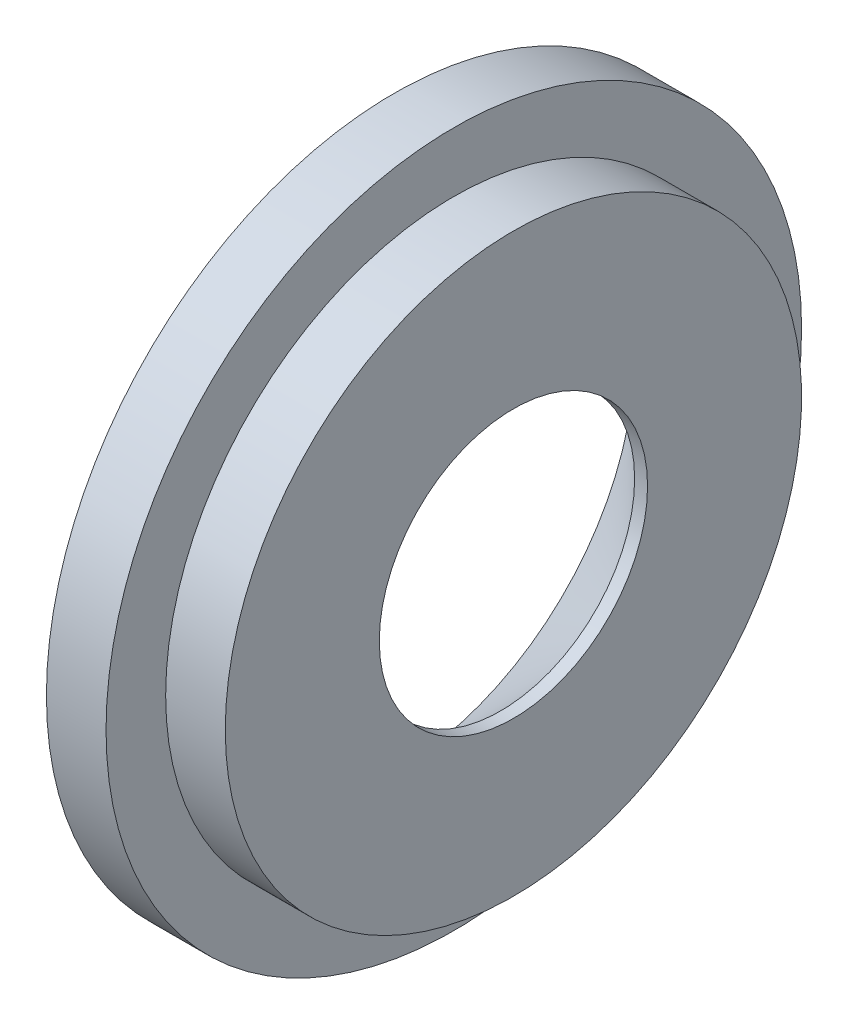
ISO-10303-21;
HEADER;
FILE_DESCRIPTION(('STEP AP214'),'2;1');
FILE_NAME('part.step','',(''),(''),'','','');
FILE_SCHEMA(('AUTOMOTIVE_DESIGN { 1 0 10303 214 1 1 1 1 }'));
ENDSEC;
DATA;
#1=APPLICATION_CONTEXT('core data for automotive mechanical design processes');
#2=APPLICATION_PROTOCOL_DEFINITION('international standard','automotive_design',2000,#1);
#3=PRODUCT_CONTEXT('',#1,'mechanical');
#4=PRODUCT('Part','Part','',(#3));
#5=PRODUCT_RELATED_PRODUCT_CATEGORY('part','',(#4));
#6=PRODUCT_DEFINITION_FORMATION('','',#4);
#7=PRODUCT_DEFINITION_CONTEXT('part definition',#1,'design');
#8=PRODUCT_DEFINITION('design','',#6,#7);
#9=PRODUCT_DEFINITION_SHAPE('','',#8);
#10=(LENGTH_UNIT() NAMED_UNIT(*) SI_UNIT(.MILLI.,.METRE.));
#11=(NAMED_UNIT(*) PLANE_ANGLE_UNIT() SI_UNIT($,.RADIAN.));
#12=(NAMED_UNIT(*) SI_UNIT($,.STERADIAN.) SOLID_ANGLE_UNIT());
#13=UNCERTAINTY_MEASURE_WITH_UNIT(LENGTH_MEASURE(1.E-05),#10,'distance_accuracy_value','');
#14=(GEOMETRIC_REPRESENTATION_CONTEXT(3) GLOBAL_UNCERTAINTY_ASSIGNED_CONTEXT((#13)) GLOBAL_UNIT_ASSIGNED_CONTEXT((#10,
#11,#12)) REPRESENTATION_CONTEXT('',''));
#15=CARTESIAN_POINT('',(0.,0.,0.));
#16=DIRECTION('',(0.,0.,1.));
#17=DIRECTION('',(1.,0.,0.));
#18=AXIS2_PLACEMENT_3D('',#15,#16,#17);
#19=CARTESIAN_POINT('',(0.,0.,0.));
#20=DIRECTION('',(-1.,0.,0.));
#21=DIRECTION('',(0.,0.,1.));
#22=AXIS2_PLACEMENT_3D('',#19,#20,#21);
#23=CYLINDRICAL_SURFACE('',#22,17.5);
#24=CARTESIAN_POINT('',(0.,0.,0.));
#25=DIRECTION('',(-1.,0.,0.));
#26=DIRECTION('',(0.,0.,1.));
#27=AXIS2_PLACEMENT_3D('',#24,#25,#26);
#28=CIRCLE('',#27,17.5);
#29=CARTESIAN_POINT('',(0.,0.,17.5));
#30=VERTEX_POINT('',#29);
#31=EDGE_CURVE('E59',#30,#30,#28,.T.);
#32=ORIENTED_EDGE('',*,*,#31,.F.);
#33=EDGE_LOOP('',(#32));
#34=FACE_BOUND('',#33,.T.);
#35=CARTESIAN_POINT('',(3.00000000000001,0.,0.));
#36=DIRECTION('',(-1.,0.,0.));
#37=DIRECTION('',(0.,0.,1.));
#38=AXIS2_PLACEMENT_3D('',#35,#36,#37);
#39=CIRCLE('',#38,17.5);
#40=CARTESIAN_POINT('',(3.00000000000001,0.,17.5));
#41=VERTEX_POINT('',#40);
#42=EDGE_CURVE('E10',#41,#41,#39,.T.);
#43=ORIENTED_EDGE('',*,*,#42,.T.);
#44=EDGE_LOOP('',(#43));
#45=FACE_BOUND('',#44,.T.);
#46=ADVANCED_FACE('F34',(#34,#45),#23,.T.);
#47=CARTESIAN_POINT('',(3.,14.5,0.));
#48=DIRECTION('',(-1.,0.,0.));
#49=DIRECTION('',(0.,0.,1.));
#50=AXIS2_PLACEMENT_3D('',#47,#48,#49);
#51=PLANE('',#50);
#52=ORIENTED_EDGE('',*,*,#42,.F.);
#53=EDGE_LOOP('',(#52));
#54=FACE_BOUND('',#53,.T.);
#55=CARTESIAN_POINT('',(3.,0.,0.));
#56=DIRECTION('',(-1.,0.,0.));
#57=DIRECTION('',(0.,0.,1.));
#58=AXIS2_PLACEMENT_3D('',#55,#56,#57);
#59=CIRCLE('',#58,14.5);
#60=CARTESIAN_POINT('',(3.,0.,14.5));
#61=VERTEX_POINT('',#60);
#62=EDGE_CURVE('E40',#61,#61,#59,.T.);
#63=ORIENTED_EDGE('',*,*,#62,.T.);
#64=EDGE_LOOP('',(#63));
#65=FACE_BOUND('',#64,.T.);
#66=ADVANCED_FACE('F66',(#54,#65),#51,.F.);
#67=CARTESIAN_POINT('',(0.,0.,0.));
#68=DIRECTION('',(-1.,0.,0.));
#69=DIRECTION('',(0.,0.,1.));
#70=AXIS2_PLACEMENT_3D('',#67,#68,#69);
#71=CYLINDRICAL_SURFACE('',#70,14.5);
#72=ORIENTED_EDGE('',*,*,#62,.F.);
#73=EDGE_LOOP('',(#72));
#74=FACE_BOUND('',#73,.T.);
#75=CARTESIAN_POINT('',(6.,0.,0.));
#76=DIRECTION('',(-1.,0.,0.));
#77=DIRECTION('',(0.,0.,1.));
#78=AXIS2_PLACEMENT_3D('',#75,#76,#77);
#79=CIRCLE('',#78,14.5);
#80=CARTESIAN_POINT('',(6.,0.,14.5));
#81=VERTEX_POINT('',#80);
#82=EDGE_CURVE('E44',#81,#81,#79,.T.);
#83=ORIENTED_EDGE('',*,*,#82,.T.);
#84=EDGE_LOOP('',(#83));
#85=FACE_BOUND('',#84,.T.);
#86=ADVANCED_FACE('F70',(#74,#85),#71,.T.);
#87=CARTESIAN_POINT('',(6.,6.75,0.));
#88=DIRECTION('',(-1.,0.,0.));
#89=DIRECTION('',(0.,0.,1.));
#90=AXIS2_PLACEMENT_3D('',#87,#88,#89);
#91=PLANE('',#90);
#92=ORIENTED_EDGE('',*,*,#82,.F.);
#93=EDGE_LOOP('',(#92));
#94=FACE_BOUND('',#93,.T.);
#95=CARTESIAN_POINT('',(6.,0.,0.));
#96=DIRECTION('',(-1.,0.,0.));
#97=DIRECTION('',(0.,0.,1.));
#98=AXIS2_PLACEMENT_3D('',#95,#96,#97);
#99=CIRCLE('',#98,6.75);
#100=CARTESIAN_POINT('',(6.,0.,6.75));
#101=VERTEX_POINT('',#100);
#102=EDGE_CURVE('E48',#101,#101,#99,.T.);
#103=ORIENTED_EDGE('',*,*,#102,.T.);
#104=EDGE_LOOP('',(#103));
#105=FACE_BOUND('',#104,.T.);
#106=ADVANCED_FACE('F75',(#94,#105),#91,.F.);
#107=CARTESIAN_POINT('',(0.,0.,0.));
#108=DIRECTION('',(-1.,0.,0.));
#109=DIRECTION('',(0.,0.,1.));
#110=AXIS2_PLACEMENT_3D('',#107,#108,#109);
#111=CYLINDRICAL_SURFACE('',#110,6.75);
#112=ORIENTED_EDGE('',*,*,#102,.F.);
#113=EDGE_LOOP('',(#112));
#114=FACE_BOUND('',#113,.T.);
#115=CARTESIAN_POINT('',(5.35,0.,0.));
#116=DIRECTION('',(-1.,0.,0.));
#117=DIRECTION('',(0.,0.,1.));
#118=AXIS2_PLACEMENT_3D('',#115,#116,#117);
#119=CIRCLE('',#118,6.75);
#120=CARTESIAN_POINT('',(5.35,0.,6.75));
#121=VERTEX_POINT('',#120);
#122=EDGE_CURVE('E53',#121,#121,#119,.T.);
#123=ORIENTED_EDGE('',*,*,#122,.T.);
#124=EDGE_LOOP('',(#123));
#125=FACE_BOUND('',#124,.T.);
#126=ADVANCED_FACE('F81',(#114,#125),#111,.F.);
#127=CARTESIAN_POINT('',(0.,0.,0.));
#128=DIRECTION('',(-1.,0.,0.));
#129=DIRECTION('',(0.,0.,1.));
#130=AXIS2_PLACEMENT_3D('',#127,#128,#129);
#131=CONICAL_SURFACE('',#130,12.1,0.78539816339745);
#132=ORIENTED_EDGE('',*,*,#122,.F.);
#133=EDGE_LOOP('',(#132));
#134=FACE_BOUND('',#133,.T.);
#135=CARTESIAN_POINT('',(0.,0.,0.));
#136=DIRECTION('',(-1.,0.,0.));
#137=DIRECTION('',(0.,0.,1.));
#138=AXIS2_PLACEMENT_3D('',#135,#136,#137);
#139=CIRCLE('',#138,12.1);
#140=CARTESIAN_POINT('',(0.,0.,12.1));
#141=VERTEX_POINT('',#140);
#142=EDGE_CURVE('E56',#141,#141,#139,.T.);
#143=ORIENTED_EDGE('',*,*,#142,.T.);
#144=EDGE_LOOP('',(#143));
#145=FACE_BOUND('',#144,.T.);
#146=ADVANCED_FACE('F85',(#134,#145),#131,.F.);
#147=CARTESIAN_POINT('',(0.,17.5,0.));
#148=DIRECTION('',(1.,0.,0.));
#149=DIRECTION('',(0.,0.,-1.));
#150=AXIS2_PLACEMENT_3D('',#147,#148,#149);
#151=PLANE('',#150);
#152=ORIENTED_EDGE('',*,*,#142,.F.);
#153=EDGE_LOOP('',(#152));
#154=FACE_BOUND('',#153,.T.);
#155=ORIENTED_EDGE('',*,*,#31,.T.);
#156=EDGE_LOOP('',(#155));
#157=FACE_BOUND('',#156,.T.);
#158=ADVANCED_FACE('F63',(#154,#157),#151,.F.);
#159=CLOSED_SHELL('',(#46,#66,#86,#106,#126,#146,#158));
#160=MANIFOLD_SOLID_BREP('B2',#159);
#161=ADVANCED_BREP_SHAPE_REPRESENTATION('',(#18,#160),#14);
#162=SHAPE_DEFINITION_REPRESENTATION(#9,#161);
ENDSEC;
END-ISO-10303-21;
